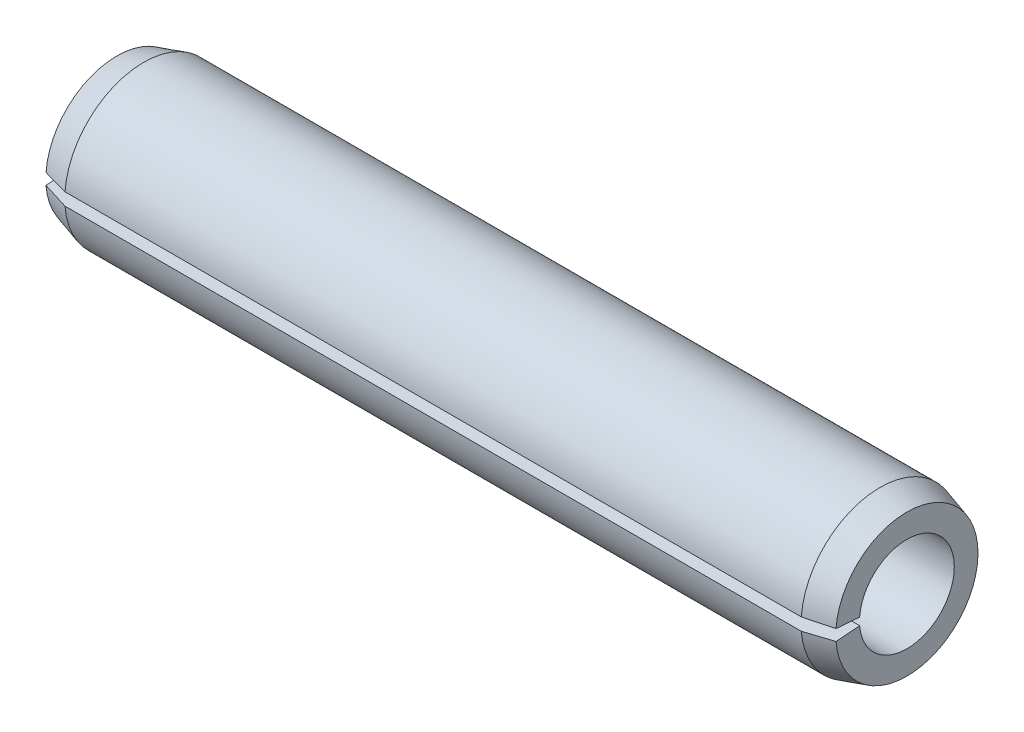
ISO-10303-21;
HEADER;
FILE_DESCRIPTION(('STEP AP214'),'2;1');
FILE_NAME('part.step','',(''),(''),'','','');
FILE_SCHEMA(('AUTOMOTIVE_DESIGN { 1 0 10303 214 1 1 1 1 }'));
ENDSEC;
DATA;
#1=APPLICATION_CONTEXT('core data for automotive mechanical design processes');
#2=APPLICATION_PROTOCOL_DEFINITION('international standard','automotive_design',2000,#1);
#3=PRODUCT_CONTEXT('',#1,'mechanical');
#4=PRODUCT('Part','Part','',(#3));
#5=PRODUCT_RELATED_PRODUCT_CATEGORY('part','',(#4));
#6=PRODUCT_DEFINITION_FORMATION('','',#4);
#7=PRODUCT_DEFINITION_CONTEXT('part definition',#1,'design');
#8=PRODUCT_DEFINITION('design','',#6,#7);
#9=PRODUCT_DEFINITION_SHAPE('','',#8);
#10=(LENGTH_UNIT() NAMED_UNIT(*) SI_UNIT(.MILLI.,.METRE.));
#11=(NAMED_UNIT(*) PLANE_ANGLE_UNIT() SI_UNIT($,.RADIAN.));
#12=(NAMED_UNIT(*) SI_UNIT($,.STERADIAN.) SOLID_ANGLE_UNIT());
#13=UNCERTAINTY_MEASURE_WITH_UNIT(LENGTH_MEASURE(1.E-05),#10,'distance_accuracy_value','');
#14=(GEOMETRIC_REPRESENTATION_CONTEXT(3) GLOBAL_UNCERTAINTY_ASSIGNED_CONTEXT((#13)) GLOBAL_UNIT_ASSIGNED_CONTEXT((#10,
#11,#12)) REPRESENTATION_CONTEXT('',''));
#15=CARTESIAN_POINT('',(0.,0.,0.));
#16=DIRECTION('',(0.,0.,1.));
#17=DIRECTION('',(1.,0.,0.));
#18=AXIS2_PLACEMENT_3D('',#15,#16,#17);
#19=CARTESIAN_POINT('',(0.,9.,0.));
#20=DIRECTION('',(1.,0.,0.));
#21=DIRECTION('',(0.,0.,-1.));
#22=AXIS2_PLACEMENT_3D('',#19,#20,#21);
#23=PLANE('',#22);
#24=DIRECTION('',(0.,0.0784590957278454,0.996917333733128));
#25=VECTOR('',#24,1.);
#26=CARTESIAN_POINT('',(0.,0.,0.));
#27=LINE('',#26,#25);
#28=CARTESIAN_POINT('',(0.,0.470754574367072,5.98150400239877));
#29=VERTEX_POINT('',#28);
#30=CARTESIAN_POINT('',(0.,0.706131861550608,8.97225600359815));
#31=VERTEX_POINT('',#30);
#32=EDGE_CURVE('E88',#29,#31,#27,.T.);
#33=ORIENTED_EDGE('',*,*,#32,.T.);
#34=CARTESIAN_POINT('',(0.,0.,0.));
#35=DIRECTION('',(-1.,0.,0.));
#36=DIRECTION('',(0.,0.,1.));
#37=AXIS2_PLACEMENT_3D('',#34,#35,#36);
#38=CIRCLE('',#37,9.);
#39=CARTESIAN_POINT('',(0.,-0.706131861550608,8.97225600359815));
#40=VERTEX_POINT('',#39);
#41=EDGE_CURVE('E106',#31,#40,#38,.T.);
#42=ORIENTED_EDGE('',*,*,#41,.T.);
#43=DIRECTION('',(0.,-0.0784590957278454,0.996917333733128));
#44=VECTOR('',#43,1.);
#45=CARTESIAN_POINT('',(0.,0.,0.));
#46=LINE('',#45,#44);
#47=CARTESIAN_POINT('',(0.,-0.470754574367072,5.98150400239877));
#48=VERTEX_POINT('',#47);
#49=EDGE_CURVE('E60',#48,#40,#46,.T.);
#50=ORIENTED_EDGE('',*,*,#49,.F.);
#51=CARTESIAN_POINT('',(0.,0.,0.));
#52=DIRECTION('',(-1.,0.,0.));
#53=DIRECTION('',(0.,0.,1.));
#54=AXIS2_PLACEMENT_3D('',#51,#52,#53);
#55=CIRCLE('',#54,6.);
#56=EDGE_CURVE('E103',#29,#48,#55,.T.);
#57=ORIENTED_EDGE('',*,*,#56,.F.);
#58=EDGE_LOOP('',(#33,#42,#50,#57));
#59=FACE_BOUND('',#58,.T.);
#60=ADVANCED_FACE('F39',(#59),#23,.F.);
#61=CARTESIAN_POINT('',(-9.52499999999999,0.,0.));
#62=DIRECTION('',(-1.,0.,0.));
#63=DIRECTION('',(0.,0.,1.));
#64=AXIS2_PLACEMENT_3D('',#61,#62,#63);
#65=CYLINDRICAL_SURFACE('',#64,6.);
#66=DIRECTION('',(-1.,0.,0.));
#67=VECTOR('',#66,1.);
#68=CARTESIAN_POINT('',(-9.52499999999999,0.470754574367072,5.98150400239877));
#69=LINE('',#68,#67);
#70=CARTESIAN_POINT('',(100.,0.470754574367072,5.98150400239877));
#71=VERTEX_POINT('',#70);
#72=EDGE_CURVE('E91',#29,#71,#69,.F.);
#73=ORIENTED_EDGE('',*,*,#72,.F.);
#74=ORIENTED_EDGE('',*,*,#56,.T.);
#75=DIRECTION('',(-1.,0.,0.));
#76=VECTOR('',#75,1.);
#77=CARTESIAN_POINT('',(-9.52499999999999,-0.470754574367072,5.98150400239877));
#78=LINE('',#77,#76);
#79=CARTESIAN_POINT('',(100.,-0.470754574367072,5.98150400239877));
#80=VERTEX_POINT('',#79);
#81=EDGE_CURVE('E124',#48,#80,#78,.F.);
#82=ORIENTED_EDGE('',*,*,#81,.T.);
#83=CARTESIAN_POINT('',(100.,0.,0.));
#84=DIRECTION('',(-1.,0.,0.));
#85=DIRECTION('',(0.,0.,1.));
#86=AXIS2_PLACEMENT_3D('',#83,#84,#85);
#87=CIRCLE('',#86,6.);
#88=EDGE_CURVE('E105',#71,#80,#87,.T.);
#89=ORIENTED_EDGE('',*,*,#88,.F.);
#90=EDGE_LOOP('',(#73,#74,#82,#89));
#91=FACE_BOUND('',#90,.T.);
#92=ADVANCED_FACE('F101',(#91),#65,.F.);
#93=CARTESIAN_POINT('',(100.,6.,0.));
#94=DIRECTION('',(-1.,0.,0.));
#95=DIRECTION('',(0.,0.,1.));
#96=AXIS2_PLACEMENT_3D('',#93,#94,#95);
#97=PLANE('',#96);
#98=DIRECTION('',(0.,0.0784590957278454,0.996917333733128));
#99=VECTOR('',#98,1.);
#100=CARTESIAN_POINT('',(100.,0.,0.));
#101=LINE('',#100,#99);
#102=CARTESIAN_POINT('',(100.,0.706131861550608,8.97225600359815));
#103=VERTEX_POINT('',#102);
#104=EDGE_CURVE('E133',#71,#103,#101,.T.);
#105=ORIENTED_EDGE('',*,*,#104,.F.);
#106=ORIENTED_EDGE('',*,*,#88,.T.);
#107=DIRECTION('',(0.,-0.0784590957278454,0.996917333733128));
#108=VECTOR('',#107,1.);
#109=CARTESIAN_POINT('',(100.,0.,0.));
#110=LINE('',#109,#108);
#111=CARTESIAN_POINT('',(100.,-0.706131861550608,8.97225600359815));
#112=VERTEX_POINT('',#111);
#113=EDGE_CURVE('E132',#80,#112,#110,.T.);
#114=ORIENTED_EDGE('',*,*,#113,.T.);
#115=CARTESIAN_POINT('',(100.,0.,0.));
#116=DIRECTION('',(-1.,0.,0.));
#117=DIRECTION('',(0.,0.,1.));
#118=AXIS2_PLACEMENT_3D('',#115,#116,#117);
#119=CIRCLE('',#118,9.);
#120=EDGE_CURVE('E110',#103,#112,#119,.T.);
#121=ORIENTED_EDGE('',*,*,#120,.F.);
#122=EDGE_LOOP('',(#105,#106,#114,#121));
#123=FACE_BOUND('',#122,.T.);
#124=ADVANCED_FACE('F143',(#123),#97,.F.);
#125=CARTESIAN_POINT('',(100.,0.,0.));
#126=DIRECTION('',(-1.,0.,0.));
#127=DIRECTION('',(0.,0.,1.));
#128=AXIS2_PLACEMENT_3D('',#125,#126,#127);
#129=CONICAL_SURFACE('',#128,9.,0.286051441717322);
#130=DIRECTION('',(-0.95936550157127,0.0221385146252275,0.281296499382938));
#131=VECTOR('',#130,1.);
#132=CARTESIAN_POINT('',(130.6,0.,0.));
#133=LINE('',#132,#131);
#134=CARTESIAN_POINT('',(96.6,0.784590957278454,9.96917333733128));
#135=VERTEX_POINT('',#134);
#136=EDGE_CURVE('E107',#103,#135,#133,.T.);
#137=ORIENTED_EDGE('',*,*,#136,.F.);
#138=ORIENTED_EDGE('',*,*,#120,.T.);
#139=DIRECTION('',(-0.95936550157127,-0.0221385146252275,0.281296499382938));
#140=VECTOR('',#139,1.);
#141=CARTESIAN_POINT('',(130.6,0.,0.));
#142=LINE('',#141,#140);
#143=CARTESIAN_POINT('',(96.6,-0.784590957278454,9.96917333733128));
#144=VERTEX_POINT('',#143);
#145=EDGE_CURVE('E126',#112,#144,#142,.T.);
#146=ORIENTED_EDGE('',*,*,#145,.T.);
#147=CARTESIAN_POINT('',(96.6,0.,0.));
#148=DIRECTION('',(-1.,0.,0.));
#149=DIRECTION('',(0.,0.,1.));
#150=AXIS2_PLACEMENT_3D('',#147,#148,#149);
#151=CIRCLE('',#150,10.);
#152=EDGE_CURVE('E115',#135,#144,#151,.T.);
#153=ORIENTED_EDGE('',*,*,#152,.F.);
#154=EDGE_LOOP('',(#137,#138,#146,#153));
#155=FACE_BOUND('',#154,.T.);
#156=ADVANCED_FACE('F142',(#155),#129,.T.);
#157=CARTESIAN_POINT('',(-9.52499999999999,0.,0.));
#158=DIRECTION('',(-1.,0.,0.));
#159=DIRECTION('',(0.,0.,1.));
#160=AXIS2_PLACEMENT_3D('',#157,#158,#159);
#161=CYLINDRICAL_SURFACE('',#160,10.);
#162=DIRECTION('',(-1.,0.,0.));
#163=VECTOR('',#162,1.);
#164=CARTESIAN_POINT('',(-9.52499999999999,0.784590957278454,9.96917333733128));
#165=LINE('',#164,#163);
#166=CARTESIAN_POINT('',(3.4,0.784590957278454,9.96917333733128));
#167=VERTEX_POINT('',#166);
#168=EDGE_CURVE('E52',#135,#167,#165,.T.);
#169=ORIENTED_EDGE('',*,*,#168,.F.);
#170=ORIENTED_EDGE('',*,*,#152,.T.);
#171=DIRECTION('',(-1.,0.,0.));
#172=VECTOR('',#171,1.);
#173=CARTESIAN_POINT('',(-9.52499999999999,-0.784590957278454,9.96917333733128));
#174=LINE('',#173,#172);
#175=CARTESIAN_POINT('',(3.4,-0.784590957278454,9.96917333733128));
#176=VERTEX_POINT('',#175);
#177=EDGE_CURVE('E129',#144,#176,#174,.T.);
#178=ORIENTED_EDGE('',*,*,#177,.T.);
#179=CARTESIAN_POINT('',(3.4,0.,0.));
#180=DIRECTION('',(-1.,0.,0.));
#181=DIRECTION('',(0.,0.,1.));
#182=AXIS2_PLACEMENT_3D('',#179,#180,#181);
#183=CIRCLE('',#182,10.);
#184=EDGE_CURVE('E118',#167,#176,#183,.T.);
#185=ORIENTED_EDGE('',*,*,#184,.F.);
#186=EDGE_LOOP('',(#169,#170,#178,#185));
#187=FACE_BOUND('',#186,.T.);
#188=ADVANCED_FACE('F146',(#187),#161,.T.);
#189=CARTESIAN_POINT('',(3.4,0.,0.));
#190=DIRECTION('',(1.,0.,0.));
#191=DIRECTION('',(0.,0.,-1.));
#192=AXIS2_PLACEMENT_3D('',#189,#190,#191);
#193=CONICAL_SURFACE('',#192,10.,0.286051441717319);
#194=DIRECTION('',(-0.959365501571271,-0.0221385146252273,-0.281296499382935));
#195=VECTOR('',#194,1.);
#196=CARTESIAN_POINT('',(-30.5999999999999,0.,0.));
#197=LINE('',#196,#195);
#198=EDGE_CURVE('E11',#167,#31,#197,.T.);
#199=ORIENTED_EDGE('',*,*,#198,.F.);
#200=ORIENTED_EDGE('',*,*,#184,.T.);
#201=DIRECTION('',(-0.959365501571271,0.0221385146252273,-0.281296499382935));
#202=VECTOR('',#201,1.);
#203=CARTESIAN_POINT('',(-30.5999999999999,0.,0.));
#204=LINE('',#203,#202);
#205=EDGE_CURVE('E46',#176,#40,#204,.T.);
#206=ORIENTED_EDGE('',*,*,#205,.T.);
#207=ORIENTED_EDGE('',*,*,#41,.F.);
#208=EDGE_LOOP('',(#199,#200,#206,#207));
#209=FACE_BOUND('',#208,.T.);
#210=ADVANCED_FACE('F149',(#209),#193,.T.);
#211=CARTESIAN_POINT('',(100.,0.,0.));
#212=DIRECTION('',(0.,-0.996917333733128,-0.0784590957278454));
#213=DIRECTION('',(0.,0.0784590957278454,-0.996917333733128));
#214=AXIS2_PLACEMENT_3D('',#211,#212,#213);
#215=PLANE('',#214);
#216=ORIENTED_EDGE('',*,*,#49,.T.);
#217=ORIENTED_EDGE('',*,*,#205,.F.);
#218=ORIENTED_EDGE('',*,*,#177,.F.);
#219=ORIENTED_EDGE('',*,*,#145,.F.);
#220=ORIENTED_EDGE('',*,*,#113,.F.);
#221=ORIENTED_EDGE('',*,*,#81,.F.);
#222=EDGE_LOOP('',(#216,#217,#218,#219,#220,#221));
#223=FACE_BOUND('',#222,.T.);
#224=ADVANCED_FACE('F144',(#223),#215,.F.);
#225=CARTESIAN_POINT('',(100.,0.,0.));
#226=DIRECTION('',(0.,-0.996917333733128,0.0784590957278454));
#227=DIRECTION('',(0.,-0.0784590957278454,-0.996917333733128));
#228=AXIS2_PLACEMENT_3D('',#225,#226,#227);
#229=PLANE('',#228);
#230=ORIENTED_EDGE('',*,*,#72,.T.);
#231=ORIENTED_EDGE('',*,*,#104,.T.);
#232=ORIENTED_EDGE('',*,*,#136,.T.);
#233=ORIENTED_EDGE('',*,*,#168,.T.);
#234=ORIENTED_EDGE('',*,*,#198,.T.);
#235=ORIENTED_EDGE('',*,*,#32,.F.);
#236=EDGE_LOOP('',(#230,#231,#232,#233,#234,#235));
#237=FACE_BOUND('',#236,.T.);
#238=ADVANCED_FACE('F90',(#237),#229,.T.);
#239=CLOSED_SHELL('',(#60,#92,#124,#156,#188,#210,#224,#238));
#240=MANIFOLD_SOLID_BREP('B2',#239);
#241=ADVANCED_BREP_SHAPE_REPRESENTATION('',(#18,#240),#14);
#242=SHAPE_DEFINITION_REPRESENTATION(#9,#241);
ENDSEC;
END-ISO-10303-21;
